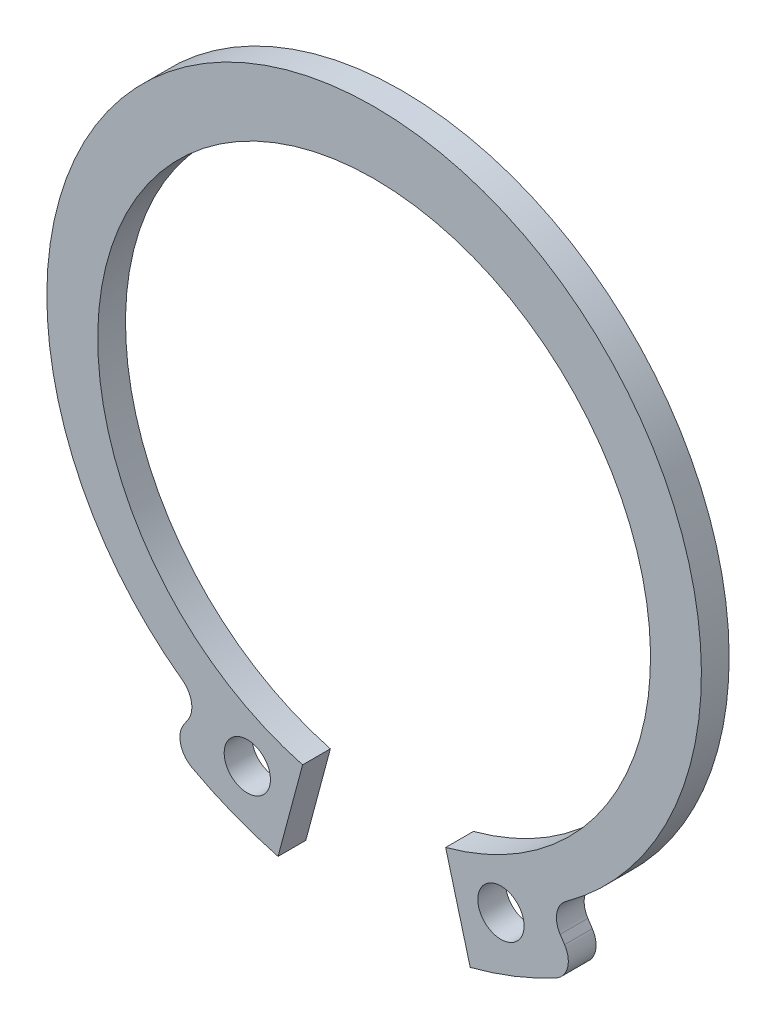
from build123d import *

# Parameters (mm, degrees)
ESQUISSE1_R          = 1
BASE_EXTRUSION_DEPTH = 1.2


with BuildPart() as part:
    # Esquisse1 → Base-Extrusion (new body)
    with BuildSketch(Plane.XY):
        with BuildLine():
            Line((8.04338538, -12.32080748), (8.233964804, -12.612735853))
            ThreePointArc((8.233964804, -12.612735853), (8.365993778, -13.404921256), (7.872777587, -14.038740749))
            ThreePointArc((7.872777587, -14.038740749), (6.057822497, -14.883705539), (4.154045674, -15.503109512))
            Line((4.154045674, -15.503109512), (3.092887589, -11.542813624))
            ThreePointArc((3.092887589, -11.542813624), (0, 11.95), (-3.092887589, -11.542813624))
            Line((-3.092887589, -11.542813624), (-4.154045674, -15.503109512))
            ThreePointArc((-4.154045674, -15.503109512), (-6.057822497, -14.883705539), (-7.872777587, -14.038740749))
            ThreePointArc((-7.872777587, -14.038740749), (-8.365993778, -13.404921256), (-8.233964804, -12.612735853))
            Line((-8.233964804, -12.612735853), (-8.04338538, -12.32080748))
            ThreePointArc((-8.04338538, -12.32080748), (-7.897450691, -11.592130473), (-8.294556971, -10.963979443))
            ThreePointArc((-8.294556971, -10.963979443), (0, 14.65), (8.294556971, -10.963979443))
            ThreePointArc((8.294556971, -10.963979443), (7.897450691, -11.592130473), (8.04338538, -12.32080748))
        make_face()
        with Locations((5.482832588, -12.790777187)):
            Circle(ESQUISSE1_R, mode=Mode.SUBTRACT)
        with Locations(Location((-5.482832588, -12.790777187, 0), (0, 0, 180))):
            Circle(ESQUISSE1_R, mode=Mode.SUBTRACT)
    extrude(amount=BASE_EXTRUSION_DEPTH)


solid = part.part
